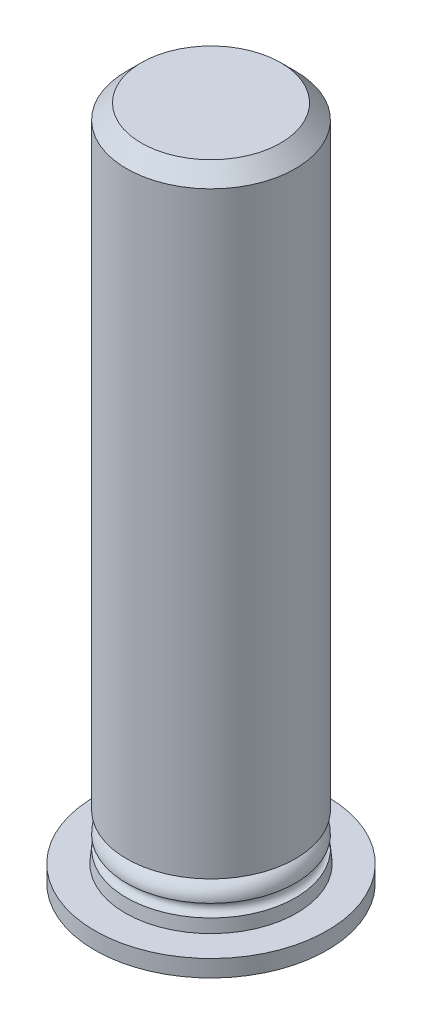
from build123d import *


with BuildPart() as part:
    # Esquisse1 → R_volution1 (revolve)
    with BuildSketch(Plane.XY, mode=Mode.PRIVATE) as r_volution1_sk:
        with BuildLine():
            Line((0, 16), (1.65, 16))
            Line((1.65, 16), (2, 15.65))
            Line((2, 15.65), (2, 1.5))
            Line((2, 1.5), (1.65, 1.5))
            Line((1.65, 1.5), (1.65, 1.35))
            ThreePointArc((1.65, 1.35), (1.897487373, 1.247487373), (2, 1))
            ThreePointArc((2, 1), (1.85, 0.85), (2, 0.7))
            Line((2, 0.7), (2.028886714, 0.4))
            Line((2.028886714, 0.4), (2.75, 0.4))
            Line((2.75, 0.4), (2.75, 0))
            Line((2.75, 0), (0, 0))
            Line((0, 0), (0, 16))
        make_face()
    revolve(r_volution1_sk.sketch.rotate(Axis((0, 0, 0), (0, 1, 0)), 90), axis=Axis((0, 0, 0), (0, 1, 0)))


solid = part.part
